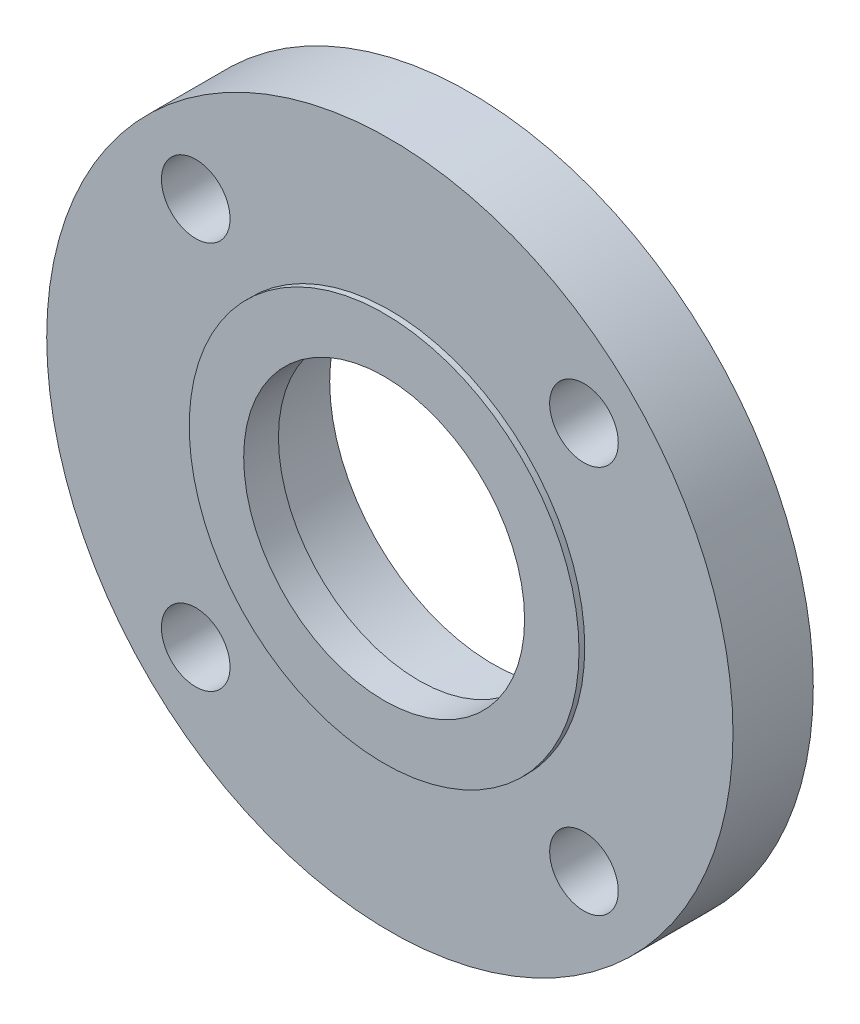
ISO-10303-21;
HEADER;
FILE_DESCRIPTION(('STEP AP214'),'2;1');
FILE_NAME('part.step','',(''),(''),'','','');
FILE_SCHEMA(('AUTOMOTIVE_DESIGN { 1 0 10303 214 1 1 1 1 }'));
ENDSEC;
DATA;
#1=APPLICATION_CONTEXT('core data for automotive mechanical design processes');
#2=APPLICATION_PROTOCOL_DEFINITION('international standard','automotive_design',2000,#1);
#3=PRODUCT_CONTEXT('',#1,'mechanical');
#4=PRODUCT('Part','Part','',(#3));
#5=PRODUCT_RELATED_PRODUCT_CATEGORY('part','',(#4));
#6=PRODUCT_DEFINITION_FORMATION('','',#4);
#7=PRODUCT_DEFINITION_CONTEXT('part definition',#1,'design');
#8=PRODUCT_DEFINITION('design','',#6,#7);
#9=PRODUCT_DEFINITION_SHAPE('','',#8);
#10=(LENGTH_UNIT() NAMED_UNIT(*) SI_UNIT(.MILLI.,.METRE.));
#11=(NAMED_UNIT(*) PLANE_ANGLE_UNIT() SI_UNIT($,.RADIAN.));
#12=(NAMED_UNIT(*) SI_UNIT($,.STERADIAN.) SOLID_ANGLE_UNIT());
#13=UNCERTAINTY_MEASURE_WITH_UNIT(LENGTH_MEASURE(1.E-05),#10,'distance_accuracy_value','');
#14=(GEOMETRIC_REPRESENTATION_CONTEXT(3) GLOBAL_UNCERTAINTY_ASSIGNED_CONTEXT((#13)) GLOBAL_UNIT_ASSIGNED_CONTEXT((#10,
#11,#12)) REPRESENTATION_CONTEXT('',''));
#15=CARTESIAN_POINT('',(0.,0.,0.));
#16=DIRECTION('',(0.,0.,1.));
#17=DIRECTION('',(1.,0.,0.));
#18=AXIS2_PLACEMENT_3D('',#15,#16,#17);
#19=CARTESIAN_POINT('',(0.,0.,-30.226));
#20=DIRECTION('',(0.,0.,1.));
#21=DIRECTION('',(1.,0.,0.));
#22=AXIS2_PLACEMENT_3D('',#19,#20,#21);
#23=CYLINDRICAL_SURFACE('',#22,38.989);
#24=CARTESIAN_POINT('',(0.,0.,0.));
#25=DIRECTION('',(0.,0.,1.));
#26=DIRECTION('',(1.,0.,0.));
#27=AXIS2_PLACEMENT_3D('',#24,#25,#26);
#28=CIRCLE('',#27,38.989);
#29=CARTESIAN_POINT('',(38.989,0.,0.));
#30=VERTEX_POINT('',#29);
#31=EDGE_CURVE('E149',#30,#30,#28,.T.);
#32=ORIENTED_EDGE('',*,*,#31,.T.);
#33=EDGE_LOOP('',(#32));
#34=FACE_BOUND('',#33,.T.);
#35=CARTESIAN_POINT('',(0.,0.,-9.652));
#36=DIRECTION('',(0.,0.,-1.));
#37=DIRECTION('',(-1.,0.,0.));
#38=AXIS2_PLACEMENT_3D('',#35,#36,#37);
#39=CIRCLE('',#38,38.989);
#40=CARTESIAN_POINT('',(-38.989,0.,-9.652));
#41=VERTEX_POINT('',#40);
#42=EDGE_CURVE('E36',#41,#41,#39,.F.);
#43=ORIENTED_EDGE('',*,*,#42,.F.);
#44=EDGE_LOOP('',(#43));
#45=FACE_BOUND('',#44,.T.);
#46=ADVANCED_FACE('F32',(#34,#45),#23,.F.);
#47=CARTESIAN_POINT('',(0.,0.,-30.226));
#48=DIRECTION('',(0.,0.,1.));
#49=DIRECTION('',(1.,0.,0.));
#50=AXIS2_PLACEMENT_3D('',#47,#48,#49);
#51=CYLINDRICAL_SURFACE('',#50,54.102);
#52=CARTESIAN_POINT('',(0.,0.,-1.5875));
#53=DIRECTION('',(0.,0.,1.));
#54=DIRECTION('',(1.,0.,0.));
#55=AXIS2_PLACEMENT_3D('',#52,#53,#54);
#56=CIRCLE('',#55,54.102);
#57=CARTESIAN_POINT('',(54.102,0.,-1.5875));
#58=VERTEX_POINT('',#57);
#59=EDGE_CURVE('E10',#58,#58,#56,.F.);
#60=ORIENTED_EDGE('',*,*,#59,.F.);
#61=EDGE_LOOP('',(#60));
#62=FACE_BOUND('',#61,.T.);
#63=CARTESIAN_POINT('',(0.,0.,0.));
#64=DIRECTION('',(0.,0.,1.));
#65=DIRECTION('',(1.,0.,0.));
#66=AXIS2_PLACEMENT_3D('',#63,#64,#65);
#67=CIRCLE('',#66,54.102);
#68=CARTESIAN_POINT('',(54.102,0.,0.));
#69=VERTEX_POINT('',#68);
#70=EDGE_CURVE('E45',#69,#69,#67,.T.);
#71=ORIENTED_EDGE('',*,*,#70,.F.);
#72=EDGE_LOOP('',(#71));
#73=FACE_BOUND('',#72,.T.);
#74=ADVANCED_FACE('F34',(#62,#73),#51,.T.);
#75=CARTESIAN_POINT('',(0.,0.,0.));
#76=DIRECTION('',(0.,0.,1.));
#77=DIRECTION('',(1.,0.,0.));
#78=AXIS2_PLACEMENT_3D('',#75,#76,#77);
#79=PLANE('',#78);
#80=ORIENTED_EDGE('',*,*,#31,.F.);
#81=EDGE_LOOP('',(#80));
#82=FACE_BOUND('',#81,.T.);
#83=ORIENTED_EDGE('',*,*,#70,.T.);
#84=EDGE_LOOP('',(#83));
#85=FACE_BOUND('',#84,.T.);
#86=ADVANCED_FACE('F90',(#82,#85),#79,.T.);
#87=CARTESIAN_POINT('',(0.,0.,-293.283683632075));
#88=DIRECTION('',(0.,0.,1.));
#89=DIRECTION('',(1.,0.,0.));
#90=AXIS2_PLACEMENT_3D('',#87,#88,#89);
#91=CYLINDRICAL_SURFACE('',#90,95.25);
#92=CARTESIAN_POINT('',(0.,0.,-23.876));
#93=DIRECTION('',(0.,0.,1.));
#94=DIRECTION('',(1.,0.,0.));
#95=AXIS2_PLACEMENT_3D('',#92,#93,#94);
#96=CIRCLE('',#95,95.25);
#97=CARTESIAN_POINT('',(95.25,0.,-23.876));
#98=VERTEX_POINT('',#97);
#99=EDGE_CURVE('E57',#98,#98,#96,.F.);
#100=ORIENTED_EDGE('',*,*,#99,.F.);
#101=EDGE_LOOP('',(#100));
#102=FACE_BOUND('',#101,.T.);
#103=CARTESIAN_POINT('',(0.,0.,-1.5875));
#104=DIRECTION('',(0.,0.,1.));
#105=DIRECTION('',(1.,0.,0.));
#106=AXIS2_PLACEMENT_3D('',#103,#104,#105);
#107=CIRCLE('',#106,95.25);
#108=CARTESIAN_POINT('',(95.25,0.,-1.5875));
#109=VERTEX_POINT('',#108);
#110=EDGE_CURVE('E52',#109,#109,#107,.T.);
#111=ORIENTED_EDGE('',*,*,#110,.F.);
#112=EDGE_LOOP('',(#111));
#113=FACE_BOUND('',#112,.T.);
#114=ADVANCED_FACE('F87',(#102,#113),#91,.T.);
#115=CARTESIAN_POINT('',(0.,0.,-1.5875));
#116=DIRECTION('',(0.,0.,1.));
#117=DIRECTION('',(1.,0.,0.));
#118=AXIS2_PLACEMENT_3D('',#115,#116,#117);
#119=PLANE('',#118);
#120=CARTESIAN_POINT('',(53.8815367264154,-53.8815367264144,-1.5875));
#121=DIRECTION('',(0.,0.,1.));
#122=DIRECTION('',(0.,-1.,0.));
#123=AXIS2_PLACEMENT_3D('',#120,#121,#122);
#124=CIRCLE('',#123,9.52499999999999);
#125=CARTESIAN_POINT('',(53.8815367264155,-63.4065367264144,-1.5875));
#126=VERTEX_POINT('',#125);
#127=EDGE_CURVE('E150',#126,#126,#124,.T.);
#128=ORIENTED_EDGE('',*,*,#127,.F.);
#129=EDGE_LOOP('',(#128));
#130=FACE_BOUND('',#129,.T.);
#131=CARTESIAN_POINT('',(-53.8815367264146,-53.8815367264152,-1.5875));
#132=DIRECTION('',(0.,0.,1.));
#133=DIRECTION('',(-1.,0.,0.));
#134=AXIS2_PLACEMENT_3D('',#131,#132,#133);
#135=CIRCLE('',#134,9.52499999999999);
#136=CARTESIAN_POINT('',(-63.4065367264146,-53.8815367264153,-1.5875));
#137=VERTEX_POINT('',#136);
#138=EDGE_CURVE('E163',#137,#137,#135,.T.);
#139=ORIENTED_EDGE('',*,*,#138,.F.);
#140=EDGE_LOOP('',(#139));
#141=FACE_BOUND('',#140,.T.);
#142=CARTESIAN_POINT('',(-53.881536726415,53.8815367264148,-1.5875));
#143=DIRECTION('',(0.,0.,1.));
#144=DIRECTION('',(0.,1.,0.));
#145=AXIS2_PLACEMENT_3D('',#142,#143,#144);
#146=CIRCLE('',#145,9.52499999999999);
#147=CARTESIAN_POINT('',(-53.8815367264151,63.4065367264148,-1.5875));
#148=VERTEX_POINT('',#147);
#149=EDGE_CURVE('E65',#148,#148,#146,.T.);
#150=ORIENTED_EDGE('',*,*,#149,.F.);
#151=EDGE_LOOP('',(#150));
#152=FACE_BOUND('',#151,.T.);
#153=CARTESIAN_POINT('',(53.881536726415,53.8815367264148,-1.5875));
#154=DIRECTION('',(0.,0.,1.));
#155=DIRECTION('',(1.,0.,0.));
#156=AXIS2_PLACEMENT_3D('',#153,#154,#155);
#157=CIRCLE('',#156,9.52499999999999);
#158=CARTESIAN_POINT('',(63.406536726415,53.8815367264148,-1.5875));
#159=VERTEX_POINT('',#158);
#160=EDGE_CURVE('E53',#159,#159,#157,.T.);
#161=ORIENTED_EDGE('',*,*,#160,.F.);
#162=EDGE_LOOP('',(#161));
#163=FACE_BOUND('',#162,.T.);
#164=ORIENTED_EDGE('',*,*,#59,.T.);
#165=EDGE_LOOP('',(#164));
#166=FACE_BOUND('',#165,.T.);
#167=ORIENTED_EDGE('',*,*,#110,.T.);
#168=EDGE_LOOP('',(#167));
#169=FACE_BOUND('',#168,.T.);
#170=ADVANCED_FACE('F82',(#130,#141,#152,#163,#166,#169),#119,.T.);
#171=CARTESIAN_POINT('',(0.,0.,-23.876));
#172=DIRECTION('',(0.,0.,1.));
#173=DIRECTION('',(1.,0.,0.));
#174=AXIS2_PLACEMENT_3D('',#171,#172,#173);
#175=PLANE('',#174);
#176=CARTESIAN_POINT('',(53.8815367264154,-53.8815367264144,-23.876));
#177=DIRECTION('',(0.,0.,1.));
#178=DIRECTION('',(0.,-1.,0.));
#179=AXIS2_PLACEMENT_3D('',#176,#177,#178);
#180=CIRCLE('',#179,9.52499999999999);
#181=CARTESIAN_POINT('',(53.8815367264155,-63.4065367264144,-23.876));
#182=VERTEX_POINT('',#181);
#183=EDGE_CURVE('E153',#182,#182,#180,.T.);
#184=ORIENTED_EDGE('',*,*,#183,.T.);
#185=EDGE_LOOP('',(#184));
#186=FACE_BOUND('',#185,.T.);
#187=CARTESIAN_POINT('',(-53.8815367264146,-53.8815367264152,-23.876));
#188=DIRECTION('',(0.,0.,1.));
#189=DIRECTION('',(-1.,0.,0.));
#190=AXIS2_PLACEMENT_3D('',#187,#188,#189);
#191=CIRCLE('',#190,9.52499999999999);
#192=CARTESIAN_POINT('',(-63.4065367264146,-53.8815367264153,-23.876));
#193=VERTEX_POINT('',#192);
#194=EDGE_CURVE('E166',#193,#193,#191,.T.);
#195=ORIENTED_EDGE('',*,*,#194,.T.);
#196=EDGE_LOOP('',(#195));
#197=FACE_BOUND('',#196,.T.);
#198=CARTESIAN_POINT('',(-53.881536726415,53.8815367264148,-23.876));
#199=DIRECTION('',(0.,0.,1.));
#200=DIRECTION('',(0.,1.,0.));
#201=AXIS2_PLACEMENT_3D('',#198,#199,#200);
#202=CIRCLE('',#201,9.52499999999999);
#203=CARTESIAN_POINT('',(-53.8815367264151,63.4065367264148,-23.876));
#204=VERTEX_POINT('',#203);
#205=EDGE_CURVE('E60',#204,#204,#202,.T.);
#206=ORIENTED_EDGE('',*,*,#205,.T.);
#207=EDGE_LOOP('',(#206));
#208=FACE_BOUND('',#207,.T.);
#209=CARTESIAN_POINT('',(53.881536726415,53.8815367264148,-23.876));
#210=DIRECTION('',(0.,0.,1.));
#211=DIRECTION('',(1.,0.,0.));
#212=AXIS2_PLACEMENT_3D('',#209,#210,#211);
#213=CIRCLE('',#212,9.52499999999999);
#214=CARTESIAN_POINT('',(63.406536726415,53.8815367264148,-23.876));
#215=VERTEX_POINT('',#214);
#216=EDGE_CURVE('E50',#215,#215,#213,.T.);
#217=ORIENTED_EDGE('',*,*,#216,.T.);
#218=EDGE_LOOP('',(#217));
#219=FACE_BOUND('',#218,.T.);
#220=CARTESIAN_POINT('',(0.,0.,-23.876));
#221=DIRECTION('',(0.,0.,1.));
#222=DIRECTION('',(1.,0.,0.));
#223=AXIS2_PLACEMENT_3D('',#220,#221,#222);
#224=CIRCLE('',#223,54.102);
#225=CARTESIAN_POINT('',(54.102,0.,-23.876));
#226=VERTEX_POINT('',#225);
#227=EDGE_CURVE('E48',#226,#226,#224,.F.);
#228=ORIENTED_EDGE('',*,*,#227,.F.);
#229=EDGE_LOOP('',(#228));
#230=FACE_BOUND('',#229,.T.);
#231=ORIENTED_EDGE('',*,*,#99,.T.);
#232=EDGE_LOOP('',(#231));
#233=FACE_BOUND('',#232,.T.);
#234=ADVANCED_FACE('F78',(#186,#197,#208,#219,#230,#233),#175,.F.);
#235=CARTESIAN_POINT('',(0.,0.,-30.226));
#236=DIRECTION('',(0.,0.,1.));
#237=DIRECTION('',(1.,0.,0.));
#238=AXIS2_PLACEMENT_3D('',#235,#236,#237);
#239=PLANE('',#238);
#240=CARTESIAN_POINT('',(0.,0.,-30.226));
#241=DIRECTION('',(0.,0.,-1.));
#242=DIRECTION('',(-1.,0.,0.));
#243=AXIS2_PLACEMENT_3D('',#240,#241,#242);
#244=CIRCLE('',#243,45.339);
#245=CARTESIAN_POINT('',(-45.339,0.,-30.226));
#246=VERTEX_POINT('',#245);
#247=EDGE_CURVE('E158',#246,#246,#244,.T.);
#248=ORIENTED_EDGE('',*,*,#247,.F.);
#249=EDGE_LOOP('',(#248));
#250=FACE_BOUND('',#249,.T.);
#251=CARTESIAN_POINT('',(0.,0.,-30.226));
#252=DIRECTION('',(0.,0.,1.));
#253=DIRECTION('',(1.,0.,0.));
#254=AXIS2_PLACEMENT_3D('',#251,#252,#253);
#255=CIRCLE('',#254,54.102);
#256=CARTESIAN_POINT('',(54.102,0.,-30.226));
#257=VERTEX_POINT('',#256);
#258=EDGE_CURVE('E40',#257,#257,#255,.T.);
#259=ORIENTED_EDGE('',*,*,#258,.F.);
#260=EDGE_LOOP('',(#259));
#261=FACE_BOUND('',#260,.T.);
#262=ADVANCED_FACE('F81',(#250,#261),#239,.F.);
#263=ORIENTED_EDGE('',*,*,#258,.T.);
#264=EDGE_LOOP('',(#263));
#265=FACE_BOUND('',#264,.T.);
#266=ORIENTED_EDGE('',*,*,#227,.T.);
#267=EDGE_LOOP('',(#266));
#268=FACE_BOUND('',#267,.T.);
#269=ADVANCED_FACE('F76',(#265,#268),#51,.T.);
#270=CARTESIAN_POINT('',(53.881536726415,53.8815367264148,-30.226));
#271=DIRECTION('',(0.,0.,1.));
#272=DIRECTION('',(1.,0.,0.));
#273=AXIS2_PLACEMENT_3D('',#270,#271,#272);
#274=CYLINDRICAL_SURFACE('',#273,9.52499999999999);
#275=ORIENTED_EDGE('',*,*,#160,.T.);
#276=EDGE_LOOP('',(#275));
#277=FACE_BOUND('',#276,.T.);
#278=ORIENTED_EDGE('',*,*,#216,.F.);
#279=EDGE_LOOP('',(#278));
#280=FACE_BOUND('',#279,.T.);
#281=ADVANCED_FACE('F126',(#277,#280),#274,.F.);
#282=CARTESIAN_POINT('',(-53.881536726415,53.8815367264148,-30.226));
#283=DIRECTION('',(0.,0.,1.));
#284=DIRECTION('',(0.,1.,0.));
#285=AXIS2_PLACEMENT_3D('',#282,#283,#284);
#286=CYLINDRICAL_SURFACE('',#285,9.52499999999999);
#287=ORIENTED_EDGE('',*,*,#149,.T.);
#288=EDGE_LOOP('',(#287));
#289=FACE_BOUND('',#288,.T.);
#290=ORIENTED_EDGE('',*,*,#205,.F.);
#291=EDGE_LOOP('',(#290));
#292=FACE_BOUND('',#291,.T.);
#293=ADVANCED_FACE('F122',(#289,#292),#286,.F.);
#294=CARTESIAN_POINT('',(-53.8815367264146,-53.8815367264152,-30.226));
#295=DIRECTION('',(0.,0.,1.));
#296=DIRECTION('',(-1.,0.,0.));
#297=AXIS2_PLACEMENT_3D('',#294,#295,#296);
#298=CYLINDRICAL_SURFACE('',#297,9.52499999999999);
#299=ORIENTED_EDGE('',*,*,#138,.T.);
#300=EDGE_LOOP('',(#299));
#301=FACE_BOUND('',#300,.T.);
#302=ORIENTED_EDGE('',*,*,#194,.F.);
#303=EDGE_LOOP('',(#302));
#304=FACE_BOUND('',#303,.T.);
#305=ADVANCED_FACE('F118',(#301,#304),#298,.F.);
#306=CARTESIAN_POINT('',(53.8815367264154,-53.8815367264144,-30.226));
#307=DIRECTION('',(0.,0.,1.));
#308=DIRECTION('',(0.,-1.,0.));
#309=AXIS2_PLACEMENT_3D('',#306,#307,#308);
#310=CYLINDRICAL_SURFACE('',#309,9.52499999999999);
#311=ORIENTED_EDGE('',*,*,#127,.T.);
#312=EDGE_LOOP('',(#311));
#313=FACE_BOUND('',#312,.T.);
#314=ORIENTED_EDGE('',*,*,#183,.F.);
#315=EDGE_LOOP('',(#314));
#316=FACE_BOUND('',#315,.T.);
#317=ADVANCED_FACE('F114',(#313,#316),#310,.F.);
#318=CARTESIAN_POINT('',(0.,0.,-9.652));
#319=DIRECTION('',(0.,0.,-1.));
#320=DIRECTION('',(-1.,0.,0.));
#321=AXIS2_PLACEMENT_3D('',#318,#319,#320);
#322=PLANE('',#321);
#323=CARTESIAN_POINT('',(0.,0.,-9.652));
#324=DIRECTION('',(0.,0.,-1.));
#325=DIRECTION('',(-1.,0.,0.));
#326=AXIS2_PLACEMENT_3D('',#323,#324,#325);
#327=CIRCLE('',#326,45.339);
#328=CARTESIAN_POINT('',(-45.339,0.,-9.652));
#329=VERTEX_POINT('',#328);
#330=EDGE_CURVE('E156',#329,#329,#327,.T.);
#331=ORIENTED_EDGE('',*,*,#330,.T.);
#332=EDGE_LOOP('',(#331));
#333=FACE_BOUND('',#332,.T.);
#334=ORIENTED_EDGE('',*,*,#42,.T.);
#335=EDGE_LOOP('',(#334));
#336=FACE_BOUND('',#335,.T.);
#337=ADVANCED_FACE('F117',(#333,#336),#322,.T.);
#338=CARTESIAN_POINT('',(0.,0.,-9.652));
#339=DIRECTION('',(0.,0.,-1.));
#340=DIRECTION('',(-1.,0.,0.));
#341=AXIS2_PLACEMENT_3D('',#338,#339,#340);
#342=CYLINDRICAL_SURFACE('',#341,45.339);
#343=ORIENTED_EDGE('',*,*,#330,.F.);
#344=EDGE_LOOP('',(#343));
#345=FACE_BOUND('',#344,.T.);
#346=ORIENTED_EDGE('',*,*,#247,.T.);
#347=EDGE_LOOP('',(#346));
#348=FACE_BOUND('',#347,.T.);
#349=ADVANCED_FACE('F112',(#345,#348),#342,.F.);
#350=CLOSED_SHELL('',(#46,#74,#86,#114,#170,#234,#262,#269,#281,#293,#305,#317,#337,#349));
#351=MANIFOLD_SOLID_BREP('B2',#350);
#352=ADVANCED_BREP_SHAPE_REPRESENTATION('',(#18,#351),#14);
#353=SHAPE_DEFINITION_REPRESENTATION(#9,#352);
ENDSEC;
END-ISO-10303-21;
